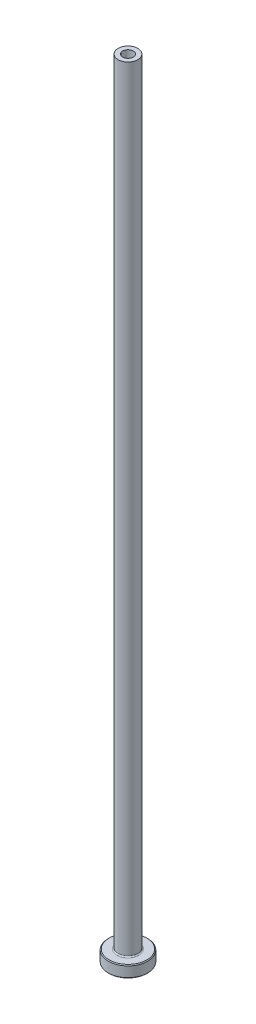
from build123d import *

# Parameters (mm, degrees)
FILLET1_R     = 0.3
CHAMFER1_SIZE = 0.2
CHAMFER3_SIZE = 0.5


with BuildPart() as part:
    # Sketch1 → Revolve1 (revolve)
    with BuildSketch(Plane.XY, mode=Mode.PRIVATE) as revolve1_sk:
        Polygon((-1.35, 200), (-2.5, 200), (-2.5, 3), (-5, 3), (-5, 0), (-1.6, 0), (-1.6, 143), (-1.35, 155), align=None)
    revolve(revolve1_sk.sketch.rotate(Axis((0, 92.187680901, 0), (0, -1, 0)), 270), axis=Axis((0, 92.187680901, 0), (0, -1, 0)))

    # Fillet1
    fillet1_edges = [part.edges().sort_by_distance(p)[0] for p in [
        (0, 3, -2.5),
    ]]
    fillet(fillet1_edges, radius=FILLET1_R)

    # Chamfer1
    chamfer1_edges = [part.edges().sort_by_distance(p)[0] for p in [
        (0, 0, -5),
        (0, 3, -5),
    ]]
    chamfer(chamfer1_edges, length=CHAMFER1_SIZE)

    # Chamfer3
    chamfer3_edges = [part.edges().sort_by_distance(p)[0] for p in [
        (0, 0, -1.6),
    ]]
    chamfer(chamfer3_edges, length=CHAMFER3_SIZE)


solid = part.part
